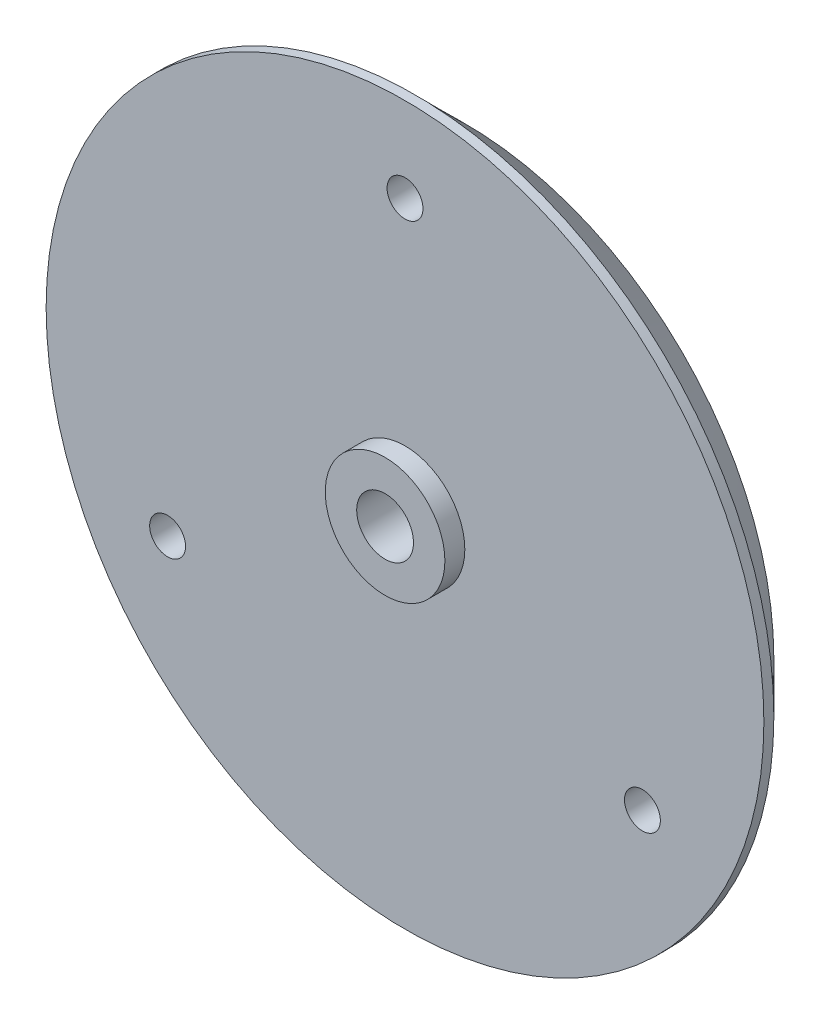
ISO-10303-21;
HEADER;
FILE_DESCRIPTION(('STEP AP214'),'2;1');
FILE_NAME('part.step','',(''),(''),'','','');
FILE_SCHEMA(('AUTOMOTIVE_DESIGN { 1 0 10303 214 1 1 1 1 }'));
ENDSEC;
DATA;
#1=APPLICATION_CONTEXT('core data for automotive mechanical design processes');
#2=APPLICATION_PROTOCOL_DEFINITION('international standard','automotive_design',2000,#1);
#3=PRODUCT_CONTEXT('',#1,'mechanical');
#4=PRODUCT('Part','Part','',(#3));
#5=PRODUCT_RELATED_PRODUCT_CATEGORY('part','',(#4));
#6=PRODUCT_DEFINITION_FORMATION('','',#4);
#7=PRODUCT_DEFINITION_CONTEXT('part definition',#1,'design');
#8=PRODUCT_DEFINITION('design','',#6,#7);
#9=PRODUCT_DEFINITION_SHAPE('','',#8);
#10=(LENGTH_UNIT() NAMED_UNIT(*) SI_UNIT(.MILLI.,.METRE.));
#11=(NAMED_UNIT(*) PLANE_ANGLE_UNIT() SI_UNIT($,.RADIAN.));
#12=(NAMED_UNIT(*) SI_UNIT($,.STERADIAN.) SOLID_ANGLE_UNIT());
#13=UNCERTAINTY_MEASURE_WITH_UNIT(LENGTH_MEASURE(1.E-05),#10,'distance_accuracy_value','');
#14=(GEOMETRIC_REPRESENTATION_CONTEXT(3) GLOBAL_UNCERTAINTY_ASSIGNED_CONTEXT((#13)) GLOBAL_UNIT_ASSIGNED_CONTEXT((#10,
#11,#12)) REPRESENTATION_CONTEXT('',''));
#15=CARTESIAN_POINT('',(0.,0.,0.));
#16=DIRECTION('',(0.,0.,1.));
#17=DIRECTION('',(1.,0.,0.));
#18=AXIS2_PLACEMENT_3D('',#15,#16,#17);
#19=CARTESIAN_POINT('',(0.,0.,3.));
#20=DIRECTION('',(0.,0.,1.));
#21=DIRECTION('',(1.,0.,0.));
#22=AXIS2_PLACEMENT_3D('',#19,#20,#21);
#23=PLANE('',#22);
#24=CARTESIAN_POINT('',(0.,0.,3.));
#25=DIRECTION('',(0.,0.,1.));
#26=DIRECTION('',(1.,0.,0.));
#27=AXIS2_PLACEMENT_3D('',#24,#25,#26);
#28=CIRCLE('',#27,18.);
#29=CARTESIAN_POINT('',(18.,0.,3.));
#30=VERTEX_POINT('',#29);
#31=EDGE_CURVE('E205',#30,#30,#28,.T.);
#32=ORIENTED_EDGE('',*,*,#31,.T.);
#33=EDGE_LOOP('',(#32));
#34=FACE_BOUND('',#33,.T.);
#35=CARTESIAN_POINT('',(0.,13.75,3.));
#36=DIRECTION('',(0.,0.,-1.));
#37=DIRECTION('',(-1.,0.,0.));
#38=AXIS2_PLACEMENT_3D('',#35,#36,#37);
#39=CIRCLE('',#38,0.9);
#40=CARTESIAN_POINT('',(-0.9,13.75,3.));
#41=VERTEX_POINT('',#40);
#42=EDGE_CURVE('E259',#41,#41,#39,.T.);
#43=ORIENTED_EDGE('',*,*,#42,.T.);
#44=EDGE_LOOP('',(#43));
#45=FACE_BOUND('',#44,.T.);
#46=CARTESIAN_POINT('',(11.907849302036,-6.87500000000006,3.));
#47=DIRECTION('',(0.,0.,-1.));
#48=DIRECTION('',(0.500000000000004,0.866025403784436,0.));
#49=AXIS2_PLACEMENT_3D('',#46,#47,#48);
#50=CIRCLE('',#49,0.9);
#51=CARTESIAN_POINT('',(12.357849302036,-6.09557713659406,3.));
#52=VERTEX_POINT('',#51);
#53=EDGE_CURVE('E265',#52,#52,#50,.T.);
#54=ORIENTED_EDGE('',*,*,#53,.T.);
#55=EDGE_LOOP('',(#54));
#56=FACE_BOUND('',#55,.T.);
#57=CARTESIAN_POINT('',(-11.9078493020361,-6.87499999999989,3.));
#58=DIRECTION('',(0.,0.,-1.));
#59=DIRECTION('',(0.499999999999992,-0.866025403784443,0.));
#60=AXIS2_PLACEMENT_3D('',#57,#58,#59);
#61=CIRCLE('',#60,0.9);
#62=CARTESIAN_POINT('',(-11.4578493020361,-7.65442286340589,3.));
#63=VERTEX_POINT('',#62);
#64=EDGE_CURVE('E271',#63,#63,#61,.T.);
#65=ORIENTED_EDGE('',*,*,#64,.T.);
#66=EDGE_LOOP('',(#65));
#67=FACE_BOUND('',#66,.T.);
#68=CARTESIAN_POINT('',(0.,0.,3.));
#69=DIRECTION('',(0.,0.,1.));
#70=DIRECTION('',(1.,0.,0.));
#71=AXIS2_PLACEMENT_3D('',#68,#69,#70);
#72=CIRCLE('',#71,3.);
#73=CARTESIAN_POINT('',(3.,0.,3.));
#74=VERTEX_POINT('',#73);
#75=EDGE_CURVE('E280',#74,#74,#72,.T.);
#76=ORIENTED_EDGE('',*,*,#75,.F.);
#77=EDGE_LOOP('',(#76));
#78=FACE_BOUND('',#77,.T.);
#79=ADVANCED_FACE('F194',(#34,#45,#56,#67,#78),#23,.T.);
#80=CARTESIAN_POINT('',(0.,0.,0.));
#81=DIRECTION('',(0.,0.,1.));
#82=DIRECTION('',(1.,0.,0.));
#83=AXIS2_PLACEMENT_3D('',#80,#81,#82);
#84=PLANE('',#83);
#85=CARTESIAN_POINT('',(0.,0.,0.));
#86=DIRECTION('',(0.,0.,-1.));
#87=DIRECTION('',(-1.,0.,0.));
#88=AXIS2_PLACEMENT_3D('',#85,#86,#87);
#89=CIRCLE('',#88,8.95);
#90=CARTESIAN_POINT('',(-8.95,0.,0.));
#91=VERTEX_POINT('',#90);
#92=EDGE_CURVE('E241',#91,#91,#89,.T.);
#93=ORIENTED_EDGE('',*,*,#92,.F.);
#94=EDGE_LOOP('',(#93));
#95=FACE_BOUND('',#94,.T.);
#96=CARTESIAN_POINT('',(0.,0.,0.));
#97=DIRECTION('',(0.,0.,-1.));
#98=DIRECTION('',(-1.,0.,0.));
#99=AXIS2_PLACEMENT_3D('',#96,#97,#98);
#100=CIRCLE('',#99,10.95);
#101=CARTESIAN_POINT('',(-10.95,0.,0.));
#102=VERTEX_POINT('',#101);
#103=EDGE_CURVE('E247',#102,#102,#100,.T.);
#104=ORIENTED_EDGE('',*,*,#103,.T.);
#105=EDGE_LOOP('',(#104));
#106=FACE_BOUND('',#105,.T.);
#107=ADVANCED_FACE('F315',(#95,#106),#84,.F.);
#108=CARTESIAN_POINT('',(0.,0.,0.));
#109=DIRECTION('',(0.,0.,-1.));
#110=DIRECTION('',(-1.,0.,0.));
#111=AXIS2_PLACEMENT_3D('',#108,#109,#110);
#112=CIRCLE('',#111,6.95);
#113=CARTESIAN_POINT('',(-6.95,0.,0.));
#114=VERTEX_POINT('',#113);
#115=EDGE_CURVE('E229',#114,#114,#112,.T.);
#116=ORIENTED_EDGE('',*,*,#115,.F.);
#117=EDGE_LOOP('',(#116));
#118=FACE_BOUND('',#117,.T.);
#119=CARTESIAN_POINT('',(0.,0.,0.));
#120=DIRECTION('',(0.,0.,-1.));
#121=DIRECTION('',(-1.,0.,0.));
#122=AXIS2_PLACEMENT_3D('',#119,#120,#121);
#123=CIRCLE('',#122,7.95);
#124=CARTESIAN_POINT('',(-7.95,0.,0.));
#125=VERTEX_POINT('',#124);
#126=EDGE_CURVE('E235',#125,#125,#123,.T.);
#127=ORIENTED_EDGE('',*,*,#126,.T.);
#128=EDGE_LOOP('',(#127));
#129=FACE_BOUND('',#128,.T.);
#130=ADVANCED_FACE('F322',(#118,#129),#84,.F.);
#131=CARTESIAN_POINT('',(0.,0.,0.));
#132=DIRECTION('',(0.,0.,-1.));
#133=DIRECTION('',(-1.,0.,0.));
#134=AXIS2_PLACEMENT_3D('',#131,#132,#133);
#135=CIRCLE('',#134,4.95);
#136=CARTESIAN_POINT('',(-4.95,0.,0.));
#137=VERTEX_POINT('',#136);
#138=EDGE_CURVE('E214',#137,#137,#135,.T.);
#139=ORIENTED_EDGE('',*,*,#138,.F.);
#140=EDGE_LOOP('',(#139));
#141=FACE_BOUND('',#140,.T.);
#142=CARTESIAN_POINT('',(0.,0.,0.));
#143=DIRECTION('',(0.,0.,-1.));
#144=DIRECTION('',(-1.,0.,0.));
#145=AXIS2_PLACEMENT_3D('',#142,#143,#144);
#146=CIRCLE('',#145,5.95);
#147=CARTESIAN_POINT('',(-5.95,0.,0.));
#148=VERTEX_POINT('',#147);
#149=EDGE_CURVE('E223',#148,#148,#146,.T.);
#150=ORIENTED_EDGE('',*,*,#149,.T.);
#151=EDGE_LOOP('',(#150));
#152=FACE_BOUND('',#151,.T.);
#153=ADVANCED_FACE('F299',(#141,#152),#84,.F.);
#154=CARTESIAN_POINT('',(0.,0.,1.6));
#155=DIRECTION('',(0.,0.,-1.));
#156=DIRECTION('',(-1.,0.,0.));
#157=AXIS2_PLACEMENT_3D('',#154,#155,#156);
#158=CYLINDRICAL_SURFACE('',#157,4.95);
#159=CARTESIAN_POINT('',(0.,0.,1.6));
#160=DIRECTION('',(0.,0.,-1.));
#161=DIRECTION('',(-1.,0.,0.));
#162=AXIS2_PLACEMENT_3D('',#159,#160,#161);
#163=CIRCLE('',#162,4.95);
#164=CARTESIAN_POINT('',(-4.95,0.,1.6));
#165=VERTEX_POINT('',#164);
#166=EDGE_CURVE('E209',#165,#165,#163,.T.);
#167=ORIENTED_EDGE('',*,*,#166,.F.);
#168=EDGE_LOOP('',(#167));
#169=FACE_BOUND('',#168,.T.);
#170=ORIENTED_EDGE('',*,*,#138,.T.);
#171=EDGE_LOOP('',(#170));
#172=FACE_BOUND('',#171,.T.);
#173=ADVANCED_FACE('F310',(#169,#172),#158,.F.);
#174=CARTESIAN_POINT('',(0.,0.,1.6));
#175=DIRECTION('',(0.,0.,-1.));
#176=DIRECTION('',(-1.,0.,0.));
#177=AXIS2_PLACEMENT_3D('',#174,#175,#176);
#178=PLANE('',#177);
#179=CARTESIAN_POINT('',(0.,0.,1.6));
#180=DIRECTION('',(0.,0.,-1.));
#181=DIRECTION('',(-1.,0.,0.));
#182=AXIS2_PLACEMENT_3D('',#179,#180,#181);
#183=CIRCLE('',#182,3.95);
#184=CARTESIAN_POINT('',(-3.95,0.,1.6));
#185=VERTEX_POINT('',#184);
#186=EDGE_CURVE('E217',#185,#185,#183,.T.);
#187=ORIENTED_EDGE('',*,*,#186,.F.);
#188=EDGE_LOOP('',(#187));
#189=FACE_BOUND('',#188,.T.);
#190=ORIENTED_EDGE('',*,*,#166,.T.);
#191=EDGE_LOOP('',(#190));
#192=FACE_BOUND('',#191,.T.);
#193=ADVANCED_FACE('F303',(#189,#192),#178,.T.);
#194=CARTESIAN_POINT('',(0.,0.,1.6));
#195=DIRECTION('',(0.,0.,-1.));
#196=DIRECTION('',(-1.,0.,0.));
#197=AXIS2_PLACEMENT_3D('',#194,#195,#196);
#198=CYLINDRICAL_SURFACE('',#197,3.95);
#199=ORIENTED_EDGE('',*,*,#186,.T.);
#200=EDGE_LOOP('',(#199));
#201=FACE_BOUND('',#200,.T.);
#202=CARTESIAN_POINT('',(0.,0.,0.));
#203=DIRECTION('',(0.,0.,-1.));
#204=DIRECTION('',(-1.,0.,0.));
#205=AXIS2_PLACEMENT_3D('',#202,#203,#204);
#206=CIRCLE('',#205,3.95);
#207=CARTESIAN_POINT('',(-3.95,0.,0.));
#208=VERTEX_POINT('',#207);
#209=EDGE_CURVE('E220',#208,#208,#206,.T.);
#210=ORIENTED_EDGE('',*,*,#209,.F.);
#211=EDGE_LOOP('',(#210));
#212=FACE_BOUND('',#211,.T.);
#213=ADVANCED_FACE('F296',(#201,#212),#198,.T.);
#214=CARTESIAN_POINT('',(0.,0.,0.));
#215=DIRECTION('',(0.,0.,-1.));
#216=DIRECTION('',(-1.,0.,0.));
#217=AXIS2_PLACEMENT_3D('',#214,#215,#216);
#218=CIRCLE('',#217,1.425);
#219=CARTESIAN_POINT('',(-1.425,0.,0.));
#220=VERTEX_POINT('',#219);
#221=EDGE_CURVE('E286',#220,#220,#218,.T.);
#222=ORIENTED_EDGE('',*,*,#221,.F.);
#223=EDGE_LOOP('',(#222));
#224=FACE_BOUND('',#223,.T.);
#225=ORIENTED_EDGE('',*,*,#209,.T.);
#226=EDGE_LOOP('',(#225));
#227=FACE_BOUND('',#226,.T.);
#228=ADVANCED_FACE('F292',(#224,#227),#84,.F.);
#229=CARTESIAN_POINT('',(0.,0.,1.6));
#230=DIRECTION('',(0.,0.,-1.));
#231=DIRECTION('',(-1.,0.,0.));
#232=AXIS2_PLACEMENT_3D('',#229,#230,#231);
#233=CYLINDRICAL_SURFACE('',#232,6.95);
#234=CARTESIAN_POINT('',(0.,0.,1.6));
#235=DIRECTION('',(0.,0.,-1.));
#236=DIRECTION('',(-1.,0.,0.));
#237=AXIS2_PLACEMENT_3D('',#234,#235,#236);
#238=CIRCLE('',#237,6.95);
#239=CARTESIAN_POINT('',(-6.95,0.,1.6));
#240=VERTEX_POINT('',#239);
#241=EDGE_CURVE('E232',#240,#240,#238,.T.);
#242=ORIENTED_EDGE('',*,*,#241,.F.);
#243=EDGE_LOOP('',(#242));
#244=FACE_BOUND('',#243,.T.);
#245=ORIENTED_EDGE('',*,*,#115,.T.);
#246=EDGE_LOOP('',(#245));
#247=FACE_BOUND('',#246,.T.);
#248=ADVANCED_FACE('F295',(#244,#247),#233,.F.);
#249=CARTESIAN_POINT('',(0.,0.,1.6));
#250=DIRECTION('',(0.,0.,-1.));
#251=DIRECTION('',(-1.,0.,0.));
#252=AXIS2_PLACEMENT_3D('',#249,#250,#251);
#253=PLANE('',#252);
#254=CARTESIAN_POINT('',(0.,0.,1.6));
#255=DIRECTION('',(0.,0.,-1.));
#256=DIRECTION('',(-1.,0.,0.));
#257=AXIS2_PLACEMENT_3D('',#254,#255,#256);
#258=CIRCLE('',#257,5.95);
#259=CARTESIAN_POINT('',(-5.95,0.,1.6));
#260=VERTEX_POINT('',#259);
#261=EDGE_CURVE('E226',#260,#260,#258,.T.);
#262=ORIENTED_EDGE('',*,*,#261,.F.);
#263=EDGE_LOOP('',(#262));
#264=FACE_BOUND('',#263,.T.);
#265=ORIENTED_EDGE('',*,*,#241,.T.);
#266=EDGE_LOOP('',(#265));
#267=FACE_BOUND('',#266,.T.);
#268=ADVANCED_FACE('F348',(#264,#267),#253,.T.);
#269=CARTESIAN_POINT('',(0.,0.,1.6));
#270=DIRECTION('',(0.,0.,-1.));
#271=DIRECTION('',(-1.,0.,0.));
#272=AXIS2_PLACEMENT_3D('',#269,#270,#271);
#273=CYLINDRICAL_SURFACE('',#272,5.95);
#274=ORIENTED_EDGE('',*,*,#261,.T.);
#275=EDGE_LOOP('',(#274));
#276=FACE_BOUND('',#275,.T.);
#277=ORIENTED_EDGE('',*,*,#149,.F.);
#278=EDGE_LOOP('',(#277));
#279=FACE_BOUND('',#278,.T.);
#280=ADVANCED_FACE('F345',(#276,#279),#273,.T.);
#281=CARTESIAN_POINT('',(0.,0.,1.6));
#282=DIRECTION('',(0.,0.,-1.));
#283=DIRECTION('',(-1.,0.,0.));
#284=AXIS2_PLACEMENT_3D('',#281,#282,#283);
#285=CYLINDRICAL_SURFACE('',#284,8.95);
#286=CARTESIAN_POINT('',(0.,0.,1.6));
#287=DIRECTION('',(0.,0.,-1.));
#288=DIRECTION('',(-1.,0.,0.));
#289=AXIS2_PLACEMENT_3D('',#286,#287,#288);
#290=CIRCLE('',#289,8.95);
#291=CARTESIAN_POINT('',(-8.95,0.,1.6));
#292=VERTEX_POINT('',#291);
#293=EDGE_CURVE('E244',#292,#292,#290,.T.);
#294=ORIENTED_EDGE('',*,*,#293,.F.);
#295=EDGE_LOOP('',(#294));
#296=FACE_BOUND('',#295,.T.);
#297=ORIENTED_EDGE('',*,*,#92,.T.);
#298=EDGE_LOOP('',(#297));
#299=FACE_BOUND('',#298,.T.);
#300=ADVANCED_FACE('F347',(#296,#299),#285,.F.);
#301=CARTESIAN_POINT('',(0.,0.,1.6));
#302=DIRECTION('',(0.,0.,-1.));
#303=DIRECTION('',(-1.,0.,0.));
#304=AXIS2_PLACEMENT_3D('',#301,#302,#303);
#305=PLANE('',#304);
#306=CARTESIAN_POINT('',(0.,0.,1.6));
#307=DIRECTION('',(0.,0.,-1.));
#308=DIRECTION('',(-1.,0.,0.));
#309=AXIS2_PLACEMENT_3D('',#306,#307,#308);
#310=CIRCLE('',#309,7.95);
#311=CARTESIAN_POINT('',(-7.95,0.,1.6));
#312=VERTEX_POINT('',#311);
#313=EDGE_CURVE('E238',#312,#312,#310,.T.);
#314=ORIENTED_EDGE('',*,*,#313,.F.);
#315=EDGE_LOOP('',(#314));
#316=FACE_BOUND('',#315,.T.);
#317=ORIENTED_EDGE('',*,*,#293,.T.);
#318=EDGE_LOOP('',(#317));
#319=FACE_BOUND('',#318,.T.);
#320=ADVANCED_FACE('F354',(#316,#319),#305,.T.);
#321=CARTESIAN_POINT('',(0.,0.,1.6));
#322=DIRECTION('',(0.,0.,-1.));
#323=DIRECTION('',(-1.,0.,0.));
#324=AXIS2_PLACEMENT_3D('',#321,#322,#323);
#325=CYLINDRICAL_SURFACE('',#324,7.95);
#326=ORIENTED_EDGE('',*,*,#313,.T.);
#327=EDGE_LOOP('',(#326));
#328=FACE_BOUND('',#327,.T.);
#329=ORIENTED_EDGE('',*,*,#126,.F.);
#330=EDGE_LOOP('',(#329));
#331=FACE_BOUND('',#330,.T.);
#332=ADVANCED_FACE('F362',(#328,#331),#325,.T.);
#333=CARTESIAN_POINT('',(0.,0.,1.6));
#334=DIRECTION('',(0.,0.,-1.));
#335=DIRECTION('',(-1.,0.,0.));
#336=AXIS2_PLACEMENT_3D('',#333,#334,#335);
#337=CYLINDRICAL_SURFACE('',#336,11.95);
#338=CARTESIAN_POINT('',(0.,0.,1.6));
#339=DIRECTION('',(0.,0.,-1.));
#340=DIRECTION('',(-1.,0.,0.));
#341=AXIS2_PLACEMENT_3D('',#338,#339,#340);
#342=CIRCLE('',#341,11.95);
#343=CARTESIAN_POINT('',(-11.95,0.,1.6));
#344=VERTEX_POINT('',#343);
#345=EDGE_CURVE('E256',#344,#344,#342,.T.);
#346=ORIENTED_EDGE('',*,*,#345,.F.);
#347=EDGE_LOOP('',(#346));
#348=FACE_BOUND('',#347,.T.);
#349=CARTESIAN_POINT('',(0.,0.,0.));
#350=DIRECTION('',(0.,0.,-1.));
#351=DIRECTION('',(-1.,0.,0.));
#352=AXIS2_PLACEMENT_3D('',#349,#350,#351);
#353=CIRCLE('',#352,11.95);
#354=CARTESIAN_POINT('',(-11.95,0.,0.));
#355=VERTEX_POINT('',#354);
#356=EDGE_CURVE('E253',#355,#355,#353,.T.);
#357=ORIENTED_EDGE('',*,*,#356,.T.);
#358=EDGE_LOOP('',(#357));
#359=FACE_BOUND('',#358,.T.);
#360=ADVANCED_FACE('F365',(#348,#359),#337,.F.);
#361=CARTESIAN_POINT('',(0.,0.,1.6));
#362=DIRECTION('',(0.,0.,-1.));
#363=DIRECTION('',(-1.,0.,0.));
#364=AXIS2_PLACEMENT_3D('',#361,#362,#363);
#365=PLANE('',#364);
#366=CARTESIAN_POINT('',(0.,0.,1.6));
#367=DIRECTION('',(0.,0.,-1.));
#368=DIRECTION('',(-1.,0.,0.));
#369=AXIS2_PLACEMENT_3D('',#366,#367,#368);
#370=CIRCLE('',#369,10.95);
#371=CARTESIAN_POINT('',(-10.95,0.,1.6));
#372=VERTEX_POINT('',#371);
#373=EDGE_CURVE('E250',#372,#372,#370,.T.);
#374=ORIENTED_EDGE('',*,*,#373,.F.);
#375=EDGE_LOOP('',(#374));
#376=FACE_BOUND('',#375,.T.);
#377=ORIENTED_EDGE('',*,*,#345,.T.);
#378=EDGE_LOOP('',(#377));
#379=FACE_BOUND('',#378,.T.);
#380=ADVANCED_FACE('F373',(#376,#379),#365,.T.);
#381=CARTESIAN_POINT('',(0.,0.,1.6));
#382=DIRECTION('',(0.,0.,-1.));
#383=DIRECTION('',(-1.,0.,0.));
#384=AXIS2_PLACEMENT_3D('',#381,#382,#383);
#385=CYLINDRICAL_SURFACE('',#384,10.95);
#386=ORIENTED_EDGE('',*,*,#373,.T.);
#387=EDGE_LOOP('',(#386));
#388=FACE_BOUND('',#387,.T.);
#389=ORIENTED_EDGE('',*,*,#103,.F.);
#390=EDGE_LOOP('',(#389));
#391=FACE_BOUND('',#390,.T.);
#392=ADVANCED_FACE('F370',(#388,#391),#385,.T.);
#393=CARTESIAN_POINT('',(0.,0.,3.));
#394=DIRECTION('',(0.,0.,-1.));
#395=DIRECTION('',(-1.,0.,0.));
#396=AXIS2_PLACEMENT_3D('',#393,#394,#395);
#397=CYLINDRICAL_SURFACE('',#396,18.);
#398=CARTESIAN_POINT('',(0.,0.,2.50000000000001));
#399=DIRECTION('',(0.,0.,1.));
#400=DIRECTION('',(1.,0.,0.));
#401=AXIS2_PLACEMENT_3D('',#398,#399,#400);
#402=CIRCLE('',#401,18.);
#403=CARTESIAN_POINT('',(18.,0.,2.50000000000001));
#404=VERTEX_POINT('',#403);
#405=EDGE_CURVE('E201',#404,#404,#402,.T.);
#406=ORIENTED_EDGE('',*,*,#405,.T.);
#407=EDGE_LOOP('',(#406));
#408=FACE_BOUND('',#407,.T.);
#409=ORIENTED_EDGE('',*,*,#31,.F.);
#410=EDGE_LOOP('',(#409));
#411=FACE_BOUND('',#410,.T.);
#412=ADVANCED_FACE('F196',(#408,#411),#397,.T.);
#413=CARTESIAN_POINT('',(0.,0.,2.50000000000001));
#414=DIRECTION('',(0.,0.,1.));
#415=DIRECTION('',(1.,0.,0.));
#416=AXIS2_PLACEMENT_3D('',#413,#414,#415);
#417=CONICAL_SURFACE('',#416,18.,0.78539816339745);
#418=CARTESIAN_POINT('',(0.,0.,0.));
#419=DIRECTION('',(0.,0.,1.));
#420=DIRECTION('',(1.,0.,0.));
#421=AXIS2_PLACEMENT_3D('',#418,#419,#420);
#422=CIRCLE('',#421,15.5);
#423=CARTESIAN_POINT('',(15.5,0.,0.));
#424=VERTEX_POINT('',#423);
#425=EDGE_CURVE('E11',#424,#424,#422,.F.);
#426=ORIENTED_EDGE('',*,*,#425,.F.);
#427=EDGE_LOOP('',(#426));
#428=FACE_BOUND('',#427,.T.);
#429=ORIENTED_EDGE('',*,*,#405,.F.);
#430=EDGE_LOOP('',(#429));
#431=FACE_BOUND('',#430,.T.);
#432=ADVANCED_FACE('F328',(#428,#431),#417,.T.);
#433=CARTESIAN_POINT('',(-11.9078493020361,-6.87499999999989,0.));
#434=DIRECTION('',(0.,0.,-1.));
#435=DIRECTION('',(0.499999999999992,-0.866025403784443,0.));
#436=AXIS2_PLACEMENT_3D('',#433,#434,#435);
#437=CIRCLE('',#436,0.9);
#438=CARTESIAN_POINT('',(-11.4578493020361,-7.65442286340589,0.));
#439=VERTEX_POINT('',#438);
#440=EDGE_CURVE('E274',#439,#439,#437,.T.);
#441=ORIENTED_EDGE('',*,*,#440,.F.);
#442=EDGE_LOOP('',(#441));
#443=FACE_BOUND('',#442,.T.);
#444=CARTESIAN_POINT('',(11.907849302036,-6.87500000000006,0.));
#445=DIRECTION('',(0.,0.,-1.));
#446=DIRECTION('',(0.500000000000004,0.866025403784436,0.));
#447=AXIS2_PLACEMENT_3D('',#444,#445,#446);
#448=CIRCLE('',#447,0.9);
#449=CARTESIAN_POINT('',(12.357849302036,-6.09557713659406,0.));
#450=VERTEX_POINT('',#449);
#451=EDGE_CURVE('E268',#450,#450,#448,.T.);
#452=ORIENTED_EDGE('',*,*,#451,.F.);
#453=EDGE_LOOP('',(#452));
#454=FACE_BOUND('',#453,.T.);
#455=CARTESIAN_POINT('',(0.,13.75,0.));
#456=DIRECTION('',(0.,0.,-1.));
#457=DIRECTION('',(-1.,0.,0.));
#458=AXIS2_PLACEMENT_3D('',#455,#456,#457);
#459=CIRCLE('',#458,0.9);
#460=CARTESIAN_POINT('',(-0.9,13.75,0.));
#461=VERTEX_POINT('',#460);
#462=EDGE_CURVE('E262',#461,#461,#459,.T.);
#463=ORIENTED_EDGE('',*,*,#462,.F.);
#464=EDGE_LOOP('',(#463));
#465=FACE_BOUND('',#464,.T.);
#466=ORIENTED_EDGE('',*,*,#356,.F.);
#467=EDGE_LOOP('',(#466));
#468=FACE_BOUND('',#467,.T.);
#469=ORIENTED_EDGE('',*,*,#425,.T.);
#470=EDGE_LOOP('',(#469));
#471=FACE_BOUND('',#470,.T.);
#472=ADVANCED_FACE('F298',(#443,#454,#465,#468,#471),#84,.F.);
#473=CARTESIAN_POINT('',(0.,13.75,3.));
#474=DIRECTION('',(0.,0.,-1.));
#475=DIRECTION('',(-1.,0.,0.));
#476=AXIS2_PLACEMENT_3D('',#473,#474,#475);
#477=CYLINDRICAL_SURFACE('',#476,0.9);
#478=ORIENTED_EDGE('',*,*,#42,.F.);
#479=EDGE_LOOP('',(#478));
#480=FACE_BOUND('',#479,.T.);
#481=ORIENTED_EDGE('',*,*,#462,.T.);
#482=EDGE_LOOP('',(#481));
#483=FACE_BOUND('',#482,.T.);
#484=ADVANCED_FACE('F327',(#480,#483),#477,.F.);
#485=CARTESIAN_POINT('',(11.907849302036,-6.87500000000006,3.));
#486=DIRECTION('',(0.,0.,-1.));
#487=DIRECTION('',(-1.,0.,0.));
#488=AXIS2_PLACEMENT_3D('',#485,#486,#487);
#489=CYLINDRICAL_SURFACE('',#488,0.9);
#490=ORIENTED_EDGE('',*,*,#53,.F.);
#491=EDGE_LOOP('',(#490));
#492=FACE_BOUND('',#491,.T.);
#493=ORIENTED_EDGE('',*,*,#451,.T.);
#494=EDGE_LOOP('',(#493));
#495=FACE_BOUND('',#494,.T.);
#496=ADVANCED_FACE('F383',(#492,#495),#489,.F.);
#497=CARTESIAN_POINT('',(-11.9078493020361,-6.87499999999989,3.));
#498=DIRECTION('',(0.,0.,-1.));
#499=DIRECTION('',(-1.,0.,0.));
#500=AXIS2_PLACEMENT_3D('',#497,#498,#499);
#501=CYLINDRICAL_SURFACE('',#500,0.9);
#502=ORIENTED_EDGE('',*,*,#64,.F.);
#503=EDGE_LOOP('',(#502));
#504=FACE_BOUND('',#503,.T.);
#505=ORIENTED_EDGE('',*,*,#440,.T.);
#506=EDGE_LOOP('',(#505));
#507=FACE_BOUND('',#506,.T.);
#508=ADVANCED_FACE('F387',(#504,#507),#501,.F.);
#509=CARTESIAN_POINT('',(0.,0.,4.));
#510=DIRECTION('',(0.,0.,-1.));
#511=DIRECTION('',(-1.,0.,0.));
#512=AXIS2_PLACEMENT_3D('',#509,#510,#511);
#513=CYLINDRICAL_SURFACE('',#512,3.);
#514=CARTESIAN_POINT('',(0.,0.,4.));
#515=DIRECTION('',(0.,0.,1.));
#516=DIRECTION('',(1.,0.,0.));
#517=AXIS2_PLACEMENT_3D('',#514,#515,#516);
#518=CIRCLE('',#517,3.);
#519=CARTESIAN_POINT('',(3.,0.,4.));
#520=VERTEX_POINT('',#519);
#521=EDGE_CURVE('E277',#520,#520,#518,.T.);
#522=ORIENTED_EDGE('',*,*,#521,.F.);
#523=EDGE_LOOP('',(#522));
#524=FACE_BOUND('',#523,.T.);
#525=ORIENTED_EDGE('',*,*,#75,.T.);
#526=EDGE_LOOP('',(#525));
#527=FACE_BOUND('',#526,.T.);
#528=ADVANCED_FACE('F390',(#524,#527),#513,.T.);
#529=CARTESIAN_POINT('',(0.,0.,4.));
#530=DIRECTION('',(0.,0.,1.));
#531=DIRECTION('',(1.,0.,0.));
#532=AXIS2_PLACEMENT_3D('',#529,#530,#531);
#533=PLANE('',#532);
#534=CARTESIAN_POINT('',(0.,0.,4.));
#535=DIRECTION('',(0.,0.,-1.));
#536=DIRECTION('',(-1.,0.,0.));
#537=AXIS2_PLACEMENT_3D('',#534,#535,#536);
#538=CIRCLE('',#537,1.425);
#539=CARTESIAN_POINT('',(-1.425,0.,4.));
#540=VERTEX_POINT('',#539);
#541=EDGE_CURVE('E283',#540,#540,#538,.T.);
#542=ORIENTED_EDGE('',*,*,#541,.T.);
#543=EDGE_LOOP('',(#542));
#544=FACE_BOUND('',#543,.T.);
#545=ORIENTED_EDGE('',*,*,#521,.T.);
#546=EDGE_LOOP('',(#545));
#547=FACE_BOUND('',#546,.T.);
#548=ADVANCED_FACE('F393',(#544,#547),#533,.T.);
#549=CARTESIAN_POINT('',(0.,0.,4.));
#550=DIRECTION('',(0.,0.,-1.));
#551=DIRECTION('',(-1.,0.,0.));
#552=AXIS2_PLACEMENT_3D('',#549,#550,#551);
#553=CYLINDRICAL_SURFACE('',#552,1.425);
#554=ORIENTED_EDGE('',*,*,#541,.F.);
#555=EDGE_LOOP('',(#554));
#556=FACE_BOUND('',#555,.T.);
#557=ORIENTED_EDGE('',*,*,#221,.T.);
#558=EDGE_LOOP('',(#557));
#559=FACE_BOUND('',#558,.T.);
#560=ADVANCED_FACE('F290',(#556,#559),#553,.F.);
#561=CLOSED_SHELL('',(#79,#107,#130,#153,#173,#193,#213,#228,#248,#268,#280,#300,#320,#332,#360,
#380,#392,#412,#432,#472,#484,#496,#508,#528,#548,#560));
#562=MANIFOLD_SOLID_BREP('B2',#561);
#563=ADVANCED_BREP_SHAPE_REPRESENTATION('',(#18,#562),#14);
#564=SHAPE_DEFINITION_REPRESENTATION(#9,#563);
ENDSEC;
END-ISO-10303-21;
